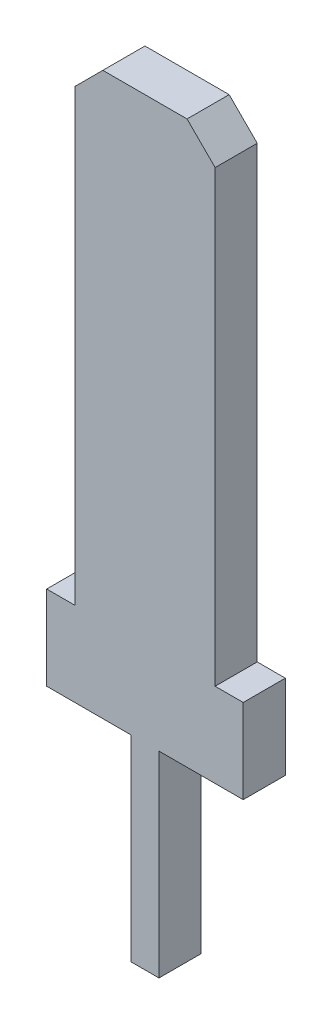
from build123d import *

# Parameters (mm, degrees)
EXTRUSION1_DEPTH = 0.375
CHANFREIN1_SIZE  = 0.5
CHANFREIN2_SIZE  = 0.5


with BuildPart() as part:
    # Esquisse1 → Extrusion1 (new, symmetric)
    with BuildSketch(Plane.XY):
        Polygon((1.25, 10), (-1.25, 10), (-1.25, 1.5), (-1.75, 1.5), (-1.75, 0), (-0.25, 0), (-0.25, -3.5), (0.25, -3.5), (0.25, 0), (1.75, 0), (1.75, 1.5), (1.25, 1.5), align=None)
    extrude(amount=EXTRUSION1_DEPTH, both=True)

    # Chanfrein1
    chanfrein1_edges = [part.edges().sort_by_distance(p)[0] for p in [
        (1.25, 10, 0),
    ]]
    chamfer(chanfrein1_edges, length=CHANFREIN1_SIZE)

    # Chanfrein2
    chanfrein2_edges = [part.edges().sort_by_distance(p)[0] for p in [
        (-1.25, 10, 0),
    ]]
    chamfer(chanfrein2_edges, length=CHANFREIN2_SIZE)


solid = part.part
